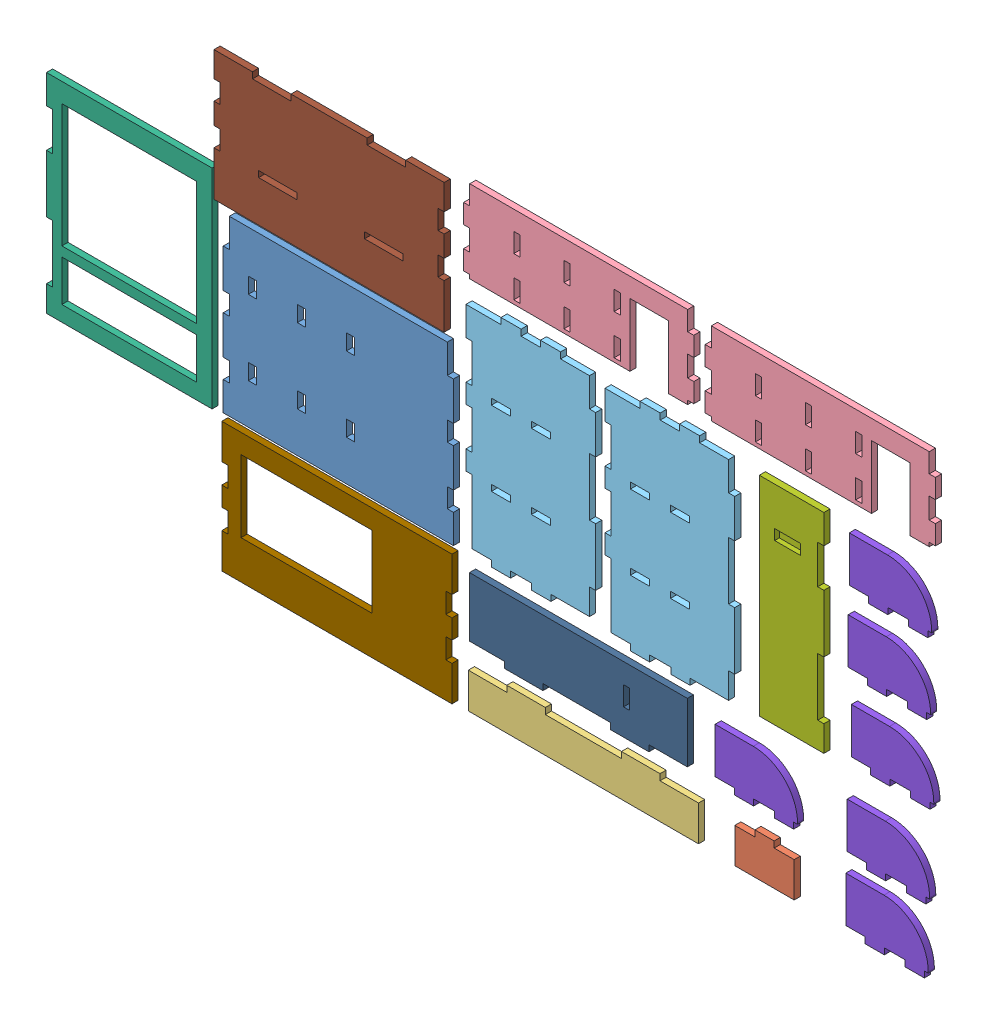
SolidWorks assembly single plane assembly.SLDASM, configuration Default (file format 9000). Lengths in mm.
Overall size (2308.33 1195.98 16).
18 component instances, 11 part files, 17 mates.
Components (placement in the parent):
- Part1-1: Part1.SLDPRT [Default] at (-313.3541 442.0628 589.8) size (597.8 450 16)
- Part10-1: Part10.SLDPRT [Default] at (999.1212 187.6964 589.8) size (154.2 106.8 16)
- Part11-1: Part11.SLDPRT [Default] at (307.0762 189.8129 589.8) size (597.8 107.8 16)
- Part12.2-1: Part12.2.SLDPRT [Default] at (310.8205 1123.3438 589.8) size (597.8 214 16)
- Part3-1: Part3.SLDPRT [Default] at (312.9552 470.3349 589.8) size (336.8 573.8 16)
- Part4-1: Part4.SLDPRT [Default] at (-788.3445 459.9504 589.8) size (430 541.8 16)
- Part5-1: Part5.SLDPRT [Default] at (1062.6621 479.7844 589.8) size (167.8 541.8 16)
- Part6-1: Part6.SLDPRT [Default] at (1291.0078 349.53 589.8) size (214 133.93 16)
- Part7-1: Part7.SLDPRT [Default] at (-317.0925 200.4339 589.8) size (597.8 336.8 16)
- Part8-1: Part8.SLDPRT [Default] at (301.0277 344.9474 589.8) size (565.8 170.2 16)
- Part9-1: Part9.SLDPRT [Default] at (-337.365 1026.1398 589.8) size (597.8 336.8 16)
- Part3-2: Part3.SLDPRT [Default] at (674.0861 462.2692 589.8) size (336.8 573.8 16)
- Part6-2: Part6.SLDPRT [Default] at (1301.8673 568.0001 589.8) size (214 133.93 16)
- Part6-3: Part6.SLDPRT [Default] at (1287.3382 181.3621 589.8) size (214 133.93 16)
- Part6-4: Part6.SLDPRT [Default] at (947.9009 346.3613 589.8) size (214 133.93 16)
- Part6-5: Part6.SLDPRT [Default] at (1293.3832 765.3958 589.8) size (214 133.93 16)
- Part6-6: Part6.SLDPRT [Default] at (1296.3447 951.0304 589.8) size (214 133.93 16)
- Part12.2-2: Part12.2.SLDPRT [Default] at (938.1876 1117.3854 589.8) size (597.8 214 16)
Mates (geometry in assembly coordinates):
- Coincident1: coincident aligned: plane of Part1-1 through (-313.3541 442.0628 605.8) normal (0 0 1); plane of Part9-1 through (-337.365 1026.1398 605.8) normal (0 0 1)
- Coincident2: coincident aligned: plane of Part1-1 through (-313.3541 442.0628 605.8) normal (0 0 1); plane of Part4-1 through (-788.3445 459.9504 605.8) normal (0 0 1)
- Coincident3: coincident aligned: plane of Part1-1 through (-313.3541 442.0628 605.8) normal (0 0 1); plane of Part3-1 through (312.9552 470.3349 605.8) normal (0 0 1)
- Coincident4: coincident aligned: plane of Part3-1 through (312.9552 470.3349 605.8) normal (0 0 1); plane of Part3-2 through (674.0861 462.2692 605.8) normal (0 0 1)
- Coincident5: coincident aligned: plane of Part12.2-1 through (310.8205 1123.3438 605.8) normal (0 0 1); plane of Part9-1 through (-337.365 1026.1398 605.8) normal (0 0 1)
- Coincident6: coincident aligned: plane of Part12.2-1 through (310.8205 1123.3438 605.8) normal (0 0 1); plane of Part12.2-2 through (938.1876 1117.3854 605.8) normal (0 0 1)
- Coincident7: coincident aligned: plane of Part5-1 through (1062.6621 479.7844 605.8) normal (0 0 1); plane of Part3-2 through (674.0861 462.2692 605.8) normal (0 0 1)
- Coincident8: coincident aligned: plane of Part1-1 through (-313.3541 442.0628 605.8) normal (0 0 1); plane of Part7-1 through (-317.0925 200.4339 605.8) normal (0 0 1)
- Coincident9: coincident aligned: plane of Part3-1 through (312.9552 470.3349 605.8) normal (0 0 1); plane of Part8-1 through (301.0277 344.9474 605.8) normal (0 0 1)
- Coincident10: coincident aligned: plane of Part11-1 through (307.0762 189.8129 605.8) normal (0 0 1); plane of Part8-1 through (301.0277 344.9474 605.8) normal (0 0 1)
- Coincident11: coincident aligned: plane of Part5-1 through (1062.6621 479.7844 605.8) normal (0 0 1); plane of Part6-6 through (1296.3447 951.0304 605.8) normal (0 0 1)
- Coincident12: coincident aligned: plane of Part6-5 through (1293.3832 765.3958 605.8) normal (0 0 1); plane of Part6-6 through (1296.3447 951.0304 605.8) normal (0 0 1)
- Coincident13: coincident aligned: plane of Part6-2 through (1301.8673 568.0001 605.8) normal (0 0 1); plane of Part6-5 through (1293.3832 765.3958 605.8) normal (0 0 1)
- Coincident14: coincident aligned: plane of Part6-2 through (1301.8673 568.0001 605.8) normal (0 0 1); plane of Part6-4 through (947.9009 346.3613 605.8) normal (0 0 1)
- Coincident15: coincident aligned: plane of Part6-1 through (1291.0078 349.53 605.8) normal (0 0 1); plane of Part6-2 through (1301.8673 568.0001 605.8) normal (0 0 1)
- Coincident16: coincident aligned: plane of Part6-1 through (1291.0078 349.53 605.8) normal (0 0 1); plane of Part6-3 through (1287.3382 181.3621 605.8) normal (0 0 1)
- Coincident17: coincident aligned: plane of Part10-1 through (999.1212 187.6964 605.8) normal (0 0 1); plane of Part6-4 through (947.9009 346.3613 605.8) normal (0 0 1)
